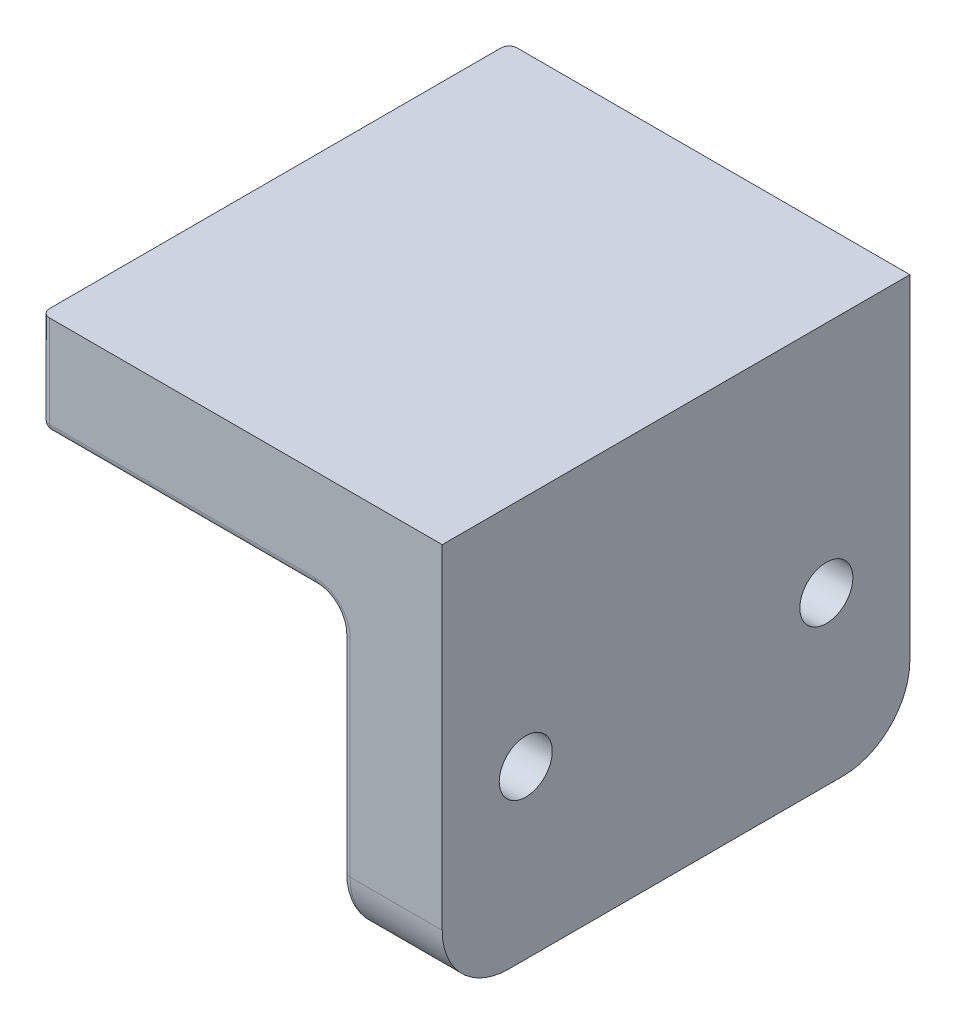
from build123d import *

# Parameters (mm, degrees)
EXTRUDE1_DEPTH                                   = 44.45
FILLET1_R                                        = 5.08
CBORE_FOR_3_8_SOCKET_HEAD_CAP_SCREW1_D           = 10.0838
CBORE_FOR_3_8_SOCKET_HEAD_CAP_SCREW1_CBORE_D     = 15.875
CBORE_FOR_3_8_SOCKET_HEAD_CAP_SCREW1_CBORE_DEPTH = 9.525
FILLET2_R                                        = 12.7
FILLET4_R                                        = 0.762
SKETCH4_W                                        = 2.645833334
SKETCH4_H                                        = 0.474893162
CUT_EXTRUDE1_DEPTH                               = 0.762
FILLET5_R                                        = 1.524
FILLET6_R                                        = 1.524


with BuildPart() as part:
    # Sketch1 → Extrude1 (new, symmetric)
    with BuildSketch(Plane.XY):
        Polygon((-76.2, 0), (-76.2, -19.05), (-19.05, -19.05), (-19.05, -76.2), (0, -76.2), (0, 0), align=None)
    extrude(amount=EXTRUDE1_DEPTH, both=True)

    # Fillet1
    fillet1_edges = [part.edges().sort_by_distance(p)[0] for p in [
        (-19.05, -19.05, 0),
    ]]
    fillet(fillet1_edges, radius=FILLET1_R)

    # CBORE for 3_8 Socket Head Cap Screw1 (through all)
    with Locations(Plane.ZY.offset(19.05)):
        with Locations((-28.575, -44.45), (28.575, -44.45)):
            CounterBoreHole(CBORE_FOR_3_8_SOCKET_HEAD_CAP_SCREW1_D / 2, CBORE_FOR_3_8_SOCKET_HEAD_CAP_SCREW1_CBORE_D / 2, CBORE_FOR_3_8_SOCKET_HEAD_CAP_SCREW1_CBORE_DEPTH)

    # Fillet2
    fillet2_edges = [part.edges().sort_by_distance(p)[0] for p in [
        (-9.525, -76.2, 44.45),
        (-9.525, -76.2, -44.45),
    ]]
    fillet(fillet2_edges, radius=FILLET2_R)

    # Fillet4
    fillet4_edges = [part.edges().sort_by_distance(p)[0] for p in [
        (-19.05, -44.45, 20.6375),
        (-9.525, -44.45, 20.6375),
        (-9.525, -44.45, 33.6169),
        (-19.05, -44.45, -36.5125),
        (-9.525, -44.45, -36.5125),
        (-9.525, -44.45, -23.5331),
    ]]
    fillet(fillet4_edges, radius=FILLET4_R)

    # Sketch4 → Cut-Extrude1 (cut)
    # profile 1 of 27: a face of its own
    with BuildSketch(Plane.XZ.offset(76.2)):
        with BuildLine():
            Line((-11.817006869, -29.627642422), (-11.817006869, -29.097627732))
            add(Edge.make_bspline(
                [(-11.817006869, -29.097627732), (-11.816851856, -29.062997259), (-11.816552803, -28.996187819), (-11.812926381, -28.899843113), (-11.806427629, -28.810960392), (-11.798396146, -28.72956013), (-11.787136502, -28.655675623), (-11.774227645, -28.58921491), (-11.758502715, -28.530162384), (-11.739831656, -28.477857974), (-11.717838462, -28.430901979), (-11.694347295, -28.386518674), (-11.666502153, -28.345376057), (-11.63631017, -28.306508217), (-11.603143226, -28.270209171), (-11.567132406, -28.236209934), (-11.527754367, -28.204860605), (-11.485280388, -28.176357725), (-11.44057521, -28.150487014), (-11.393536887, -28.127888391), (-11.344096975, -28.109556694), (-11.292573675, -28.094178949), (-11.238969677, -28.081827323), (-11.18295519, -28.073605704), (-11.124921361, -28.068021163), (-11.085423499, -28.067528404), (-11.065446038, -28.067279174)],
                knots=[0, 0, 0, 0, 1.698787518, 3.27731721, 4.728409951, 6.070286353, 7.288646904, 8.393455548, 9.389990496, 10.283725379, 11.113616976, 11.931887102, 12.744353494, 13.547053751, 14.344590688, 15.153907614, 15.974148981, 16.810666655, 17.660988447, 18.506082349, 19.367288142, 20.244738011, 21.142497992, 22.06302001, 23.020302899, 24, 24, 24, 24], degree=3))
            add(Edge.make_bspline(
                [(-11.065446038, -28.067279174), (-11.04334545, -28.067639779), (-10.999915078, -28.068348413), (-10.936251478, -28.075295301), (-10.875554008, -28.087162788), (-10.817310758, -28.102672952), (-10.76248009, -28.124300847), (-10.709753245, -28.149009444), (-10.660610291, -28.179409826), (-10.614429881, -28.214143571), (-10.570861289, -28.252089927), (-10.531070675, -28.294088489), (-10.495069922, -28.339644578), (-10.461302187, -28.387493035), (-10.432471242, -28.439605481), (-10.40557821, -28.494157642), (-10.382790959, -28.552522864), (-10.370830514, -28.593134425), (-10.364766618, -28.61372432)],
                knots=[0, 0, 0, 0, 1.101964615, 2.165495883, 3.188506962, 4.184641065, 5.166448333, 6.124117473, 7.085225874, 8.042124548, 9.003636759, 9.963451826, 10.9225791, 11.897800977, 12.880319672, 13.889154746, 14.929810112, 16, 16, 16, 16], degree=3))
            add(Edge.make_bspline(
                [(-10.364766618, -28.61372432), (-10.361392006, -28.627287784), (-10.35408151, -28.656670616), (-10.346659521, -28.705291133), (-10.339835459, -28.761321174), (-10.333971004, -28.82494192), (-10.329984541, -28.89619005), (-10.32687129, -28.974996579), (-10.324607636, -29.061397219), (-10.324527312, -29.121476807), (-10.324485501, -29.15274926)],
                knots=[0, 0, 0, 0, 0.618981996, 1.340914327, 2.176866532, 3.120127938, 4.170906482, 5.338178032, 6.614476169, 8, 8, 8, 8], degree=3))
            Line((-10.324485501, -29.15274926), (-9.171173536, -29.15274926))
            Line((-9.171173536, -29.15274926), (-9.171173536, -29.627642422))
            Line((-9.171173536, -29.627642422), (-11.817006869, -29.627642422))
        make_face()
        with BuildLine():
            Line((-10.799378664, -29.15274926), (-10.799378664, -28.984734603))
            add(Edge.make_bspline(
                [(-10.799378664, -28.984734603), (-10.799572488, -28.954161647), (-10.799929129, -28.897906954), (-10.805087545, -28.821083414), (-10.812963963, -28.759345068), (-10.824264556, -28.710574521), (-10.841403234, -28.672054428), (-10.861264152, -28.638870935), (-10.886340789, -28.610172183), (-10.915477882, -28.585850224), (-10.948300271, -28.566086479), (-10.984720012, -28.552193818), (-11.024217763, -28.543433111), (-11.051794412, -28.542600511), (-11.065976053, -28.542172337)],
                knots=[0, 0, 0, 0, 1.862197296, 3.426470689, 4.686743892, 5.65255712, 6.462325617, 7.244961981, 8.000258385, 8.771939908, 9.549006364, 10.32248703, 11.137317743, 12, 12, 12, 12], degree=3))
            add(Edge.make_bspline(
                [(-11.065976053, -28.542172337), (-11.078369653, -28.542586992), (-11.102416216, -28.543391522), (-11.137096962, -28.549383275), (-11.169363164, -28.55868278), (-11.198765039, -28.572895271), (-11.225988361, -28.590150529), (-11.250185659, -28.612040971), (-11.272139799, -28.637285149), (-11.283745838, -28.656807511), (-11.289642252, -28.666725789)],
                knots=[0, 0, 0, 0, 1.102449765, 2.139017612, 3.12397484, 4.080535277, 5.035673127, 5.982361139, 6.974944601, 8, 8, 8, 8], degree=3))
            add(Edge.make_bspline(
                [(-11.289642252, -28.666725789), (-11.293889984, -28.67512502), (-11.302883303, -28.692907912), (-11.313338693, -28.723193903), (-11.322158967, -28.758143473), (-11.329479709, -28.797992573), (-11.335161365, -28.842582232), (-11.339506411, -28.891904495), (-11.341253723, -28.946031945), (-11.341819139, -28.983674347), (-11.342113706, -29.003285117)],
                knots=[0, 0, 0, 0, 0.656809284, 1.390599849, 2.23162475, 3.173112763, 4.218524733, 5.370385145, 6.63003504, 8, 8, 8, 8], degree=3))
            Line((-11.342113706, -29.003285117), (-11.342113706, -29.15274926))
            Line((-11.342113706, -29.15274926), (-10.799378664, -29.15274926))
        make_face(mode=Mode.SUBTRACT)
    # profile 2 of 27: a face of its own
    with BuildSketch(Plane.XZ.offset(76.2)):
        Polygon((-11.817006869, -26.743832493), (-11.817006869, -26.303390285), (-9.171173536, -25.23488067), (-9.171173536, -25.742104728), (-9.713908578, -25.947750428), (-9.713908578, -27.100532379), (-9.171173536, -27.306178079), (-9.171173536, -27.812872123), align=None)
        Polygon((-11.107317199, -26.523876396), (-10.188801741, -26.920327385), (-10.188801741, -26.127425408), align=None, mode=Mode.SUBTRACT)
    # profile 3 of 27: a face of its own
    with BuildSketch(Plane.XZ.offset(76.2)):
        with BuildLine():
            Line((-11.817006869, -24.844789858), (-11.817006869, -24.291454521))
            add(Edge.make_bspline(
                [(-11.817006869, -24.291454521), (-11.816878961, -24.254878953), (-11.816632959, -24.184533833), (-11.812668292, -24.083104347), (-11.807271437, -23.989912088), (-11.798630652, -23.904910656), (-11.788443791, -23.827893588), (-11.775165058, -23.759107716), (-11.760311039, -23.698336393), (-11.741727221, -23.64514125), (-11.720798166, -23.597119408), (-11.696679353, -23.552407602), (-11.66989094, -23.509685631), (-11.638698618, -23.470330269), (-11.605885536, -23.432040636), (-11.569238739, -23.396701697), (-11.52939481, -23.363706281), (-11.486361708, -23.333650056), (-11.441048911, -23.306010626), (-11.393292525, -23.282235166), (-11.343481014, -23.261964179), (-11.291859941, -23.244931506), (-11.237914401, -23.2322319), (-11.182259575, -23.223535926), (-11.124601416, -23.21713773), (-11.085428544, -23.216771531), (-11.065446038, -23.21658473)],
                knots=[0, 0, 0, 0, 1.748890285, 3.363608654, 4.853419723, 6.211897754, 7.448506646, 8.566916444, 9.560702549, 10.437053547, 11.257979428, 12.063058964, 12.86458444, 13.665575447, 14.461919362, 15.274455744, 16.096554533, 16.933325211, 17.78237398, 18.632472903, 19.481227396, 20.352186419, 21.229229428, 22.127857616, 23.044999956, 24, 24, 24, 24], degree=3))
            add(Edge.make_bspline(
                [(-11.065446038, -23.21658473), (-11.044589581, -23.217073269), (-11.003693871, -23.218031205), (-10.943613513, -23.223148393), (-10.885993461, -23.232661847), (-10.831203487, -23.246601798), (-10.778682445, -23.263287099), (-10.729250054, -23.284896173), (-10.682031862, -23.309469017), (-10.63780598, -23.338620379), (-10.595621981, -23.370632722), (-10.557011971, -23.407811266), (-10.52014568, -23.448055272), (-10.486278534, -23.492589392), (-10.455621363, -23.541280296), (-10.426928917, -23.5932124), (-10.400710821, -23.649103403), (-10.386046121, -23.688362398), (-10.378547, -23.708438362)],
                knots=[0, 0, 0, 0, 1.099808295, 2.156523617, 3.176426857, 4.17500812, 5.135317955, 6.078349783, 7.015890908, 7.9382699, 8.868004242, 9.803692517, 10.759882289, 11.743580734, 12.748787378, 13.791075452, 14.870417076, 16, 16, 16, 16], degree=3))
            Line((-10.378547, -23.708438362), (-9.171173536, -23.097861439))
            Line((-9.171173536, -23.097861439), (-9.171173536, -23.625756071))
            Line((-9.171173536, -23.625756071), (-10.324485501, -24.20877223))
            Line((-10.324485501, -24.20877223), (-10.324485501, -24.369896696))
            Line((-10.324485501, -24.369896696), (-9.171173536, -24.369896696))
            Line((-9.171173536, -24.369896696), (-9.171173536, -24.844789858))
            Line((-9.171173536, -24.844789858), (-11.817006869, -24.844789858))
        make_face()
        with BuildLine():
            Line((-10.799378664, -24.369896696), (-10.799378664, -24.184921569))
            add(Edge.make_bspline(
                [(-10.799378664, -24.184921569), (-10.799633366, -24.162306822), (-10.800121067, -24.119004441), (-10.802383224, -24.05672993), (-10.807833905, -24.000169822), (-10.814720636, -23.949081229), (-10.822672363, -23.903207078), (-10.834067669, -23.862956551), (-10.846278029, -23.827709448), (-10.861452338, -23.797883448), (-10.878708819, -23.772400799), (-10.89831261, -23.750398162), (-10.921001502, -23.732198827), (-10.946158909, -23.717219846), (-10.974007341, -23.705567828), (-11.004241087, -23.697062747), (-11.037204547, -23.692309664), (-11.059953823, -23.691762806), (-11.071806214, -23.691477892)],
                knots=[0, 0, 0, 0, 1.688639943, 3.233382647, 4.650958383, 5.928841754, 7.082724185, 8.122798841, 9.049171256, 9.863274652, 10.613301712, 11.341792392, 12.054588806, 12.776240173, 13.521029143, 14.301969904, 15.115324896, 16, 16, 16, 16], degree=3))
            add(Edge.make_bspline(
                [(-11.071806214, -23.691477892), (-11.085836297, -23.691990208), (-11.113224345, -23.692990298), (-11.152764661, -23.703803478), (-11.189626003, -23.7201205), (-11.223308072, -23.743215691), (-11.252747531, -23.772045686), (-11.278754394, -23.805139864), (-11.299089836, -23.843359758), (-11.313369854, -23.878400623), (-11.321385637, -23.910582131), (-11.327404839, -23.939525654), (-11.331877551, -23.97301298), (-11.335498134, -24.0112138), (-11.338729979, -24.053790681), (-11.340786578, -24.101160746), (-11.341692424, -24.153117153), (-11.341969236, -24.189338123), (-11.342113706, -24.208242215)],
                knots=[0, 0, 0, 0, 1.020140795, 1.991411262, 2.965409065, 3.947543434, 4.949233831, 5.95883764, 7.001880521, 8.094604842, 8.706727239, 9.41631554, 10.248493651, 11.167128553, 12.212949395, 13.360078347, 14.622198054, 16, 16, 16, 16], degree=3))
            Line((-11.342113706, -24.208242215), (-11.342113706, -24.369896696))
            Line((-11.342113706, -24.369896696), (-10.799378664, -24.369896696))
        make_face(mode=Mode.SUBTRACT)
    # profile 4 of 27: a face of its own
    with BuildSketch(Plane.XZ.offset(76.2)):
        Polygon((-11.817006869, -22.979138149), (-11.817006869, -21.554458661), (-11.342113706, -21.554458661), (-11.342113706, -22.029351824), (-9.171173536, -22.029351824), (-9.171173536, -22.504244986), (-11.342113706, -22.504244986), (-11.342113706, -22.979138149), align=None)
    # profile 5 of 27: a face of its own
    with BuildSketch(Plane.XZ.offset(76.2)):
        Polygon((-11.817006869, -20.163700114), (-11.817006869, -19.735978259), (-10.075908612, -18.535494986), (-11.817006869, -18.535494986), (-11.817006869, -18.060601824), (-9.171173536, -18.060601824), (-9.171173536, -18.491503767), (-10.906971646, -19.688806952), (-9.171173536, -19.688806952), (-9.171173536, -20.163700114), align=None)
    # profile 6 of 27: a face of its own
    with BuildSketch(Plane.XZ.offset(76.2)):
        with BuildLine():
            Line((-11.817006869, -17.450024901), (-11.817006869, -16.975131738))
            Line((-11.817006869, -16.975131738), (-10.095519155, -16.975131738))
            add(Edge.make_bspline(
                [(-10.095519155, -16.975131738), (-10.07767164, -16.975104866), (-10.04319935, -16.975052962), (-9.99374092, -16.972570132), (-9.948109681, -16.970230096), (-9.906675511, -16.966248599), (-9.869309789, -16.960003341), (-9.835874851, -16.954172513), (-9.806668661, -16.946178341), (-9.773401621, -16.934207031), (-9.736029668, -16.915517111), (-9.696638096, -16.885873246), (-9.661576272, -16.850473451), (-9.632136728, -16.808784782), (-9.607236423, -16.762240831), (-9.590766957, -16.709924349), (-9.579596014, -16.653536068), (-9.578690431, -16.614250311), (-9.578224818, -16.594051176)],
                knots=[0, 0, 0, 0, 1.155195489, 2.231248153, 3.20507519, 4.113220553, 4.92363642, 5.657123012, 6.309133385, 6.880755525, 7.944644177, 8.999147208, 10.058600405, 11.156792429, 12.29246015, 13.460660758, 14.694375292, 16, 16, 16, 16], degree=3))
            add(Edge.make_bspline(
                [(-9.578224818, -16.594051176), (-9.57885033, -16.572615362), (-9.580069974, -16.530819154), (-9.592042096, -16.470701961), (-9.611105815, -16.415003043), (-9.638314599, -16.364901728), (-9.670929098, -16.320447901), (-9.708119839, -16.282818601), (-9.749961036, -16.253121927), (-9.788562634, -16.233766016), (-9.824092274, -16.222900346), (-9.85583586, -16.214749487), (-9.893120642, -16.208830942), (-9.935687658, -16.203289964), (-9.983847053, -16.200148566), (-10.037347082, -16.196570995), (-10.096220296, -16.195288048), (-10.137213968, -16.195065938), (-10.158590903, -16.194950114)],
                knots=[0, 0, 0, 0, 1.26131785, 2.459356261, 3.594833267, 4.716926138, 5.803419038, 6.833631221, 7.818372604, 8.814377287, 9.360705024, 10.004324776, 10.743421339, 11.582437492, 12.532246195, 13.585177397, 14.740744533, 16, 16, 16, 16], degree=3))
            Line((-10.158590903, -16.194950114), (-11.817006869, -16.194950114))
            Line((-11.817006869, -16.194950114), (-11.817006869, -15.720056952))
            Line((-11.817006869, -15.720056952), (-10.238623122, -15.720056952))
            add(Edge.make_bspline(
                [(-10.238623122, -15.720056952), (-10.206645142, -15.720122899), (-10.145154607, -15.72024971), (-10.05678838, -15.72219714), (-9.976080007, -15.726342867), (-9.903005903, -15.729824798), (-9.837664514, -15.73656353), (-9.779776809, -15.743583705), (-9.729547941, -15.752531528), (-9.672368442, -15.765845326), (-9.60652858, -15.788821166), (-9.530715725, -15.825860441), (-9.45649467, -15.872882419), (-9.38466043, -15.928448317), (-9.317992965, -15.991231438), (-9.259301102, -16.059566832), (-9.210465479, -16.133141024), (-9.17097964, -16.21161417), (-9.140575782, -16.295814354), (-9.119085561, -16.385940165), (-9.105410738, -16.482507), (-9.104038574, -16.549128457), (-9.103331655, -16.583450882)],
                knots=[0, 0, 0, 0, 1.170930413, 2.251584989, 3.235934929, 4.130173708, 4.929654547, 5.640582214, 6.264911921, 6.796838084, 7.789064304, 8.810388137, 9.880124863, 11.000704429, 12.131026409, 13.227749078, 14.29171941, 15.356377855, 16.43689688, 17.561893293, 18.743922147, 20, 20, 20, 20], degree=3))
            add(Edge.make_bspline(
                [(-9.103331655, -16.583450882), (-9.10371692, -16.60625802), (-9.104477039, -16.651256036), (-9.111144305, -16.717439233), (-9.121050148, -16.781396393), (-9.135221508, -16.843161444), (-9.154566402, -16.902521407), (-9.17742735, -16.959860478), (-9.203584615, -17.015386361), (-9.235329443, -17.067363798), (-9.268673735, -17.117069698), (-9.305157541, -17.162836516), (-9.343162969, -17.205367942), (-9.383559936, -17.244169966), (-9.426060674, -17.279278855), (-9.470706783, -17.310667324), (-9.517508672, -17.338276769), (-9.567306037, -17.362805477), (-9.622631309, -17.383797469), (-9.685450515, -17.401503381), (-9.756584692, -17.41689552), (-9.836502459, -17.428547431), (-9.924839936, -17.438817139), (-10.021934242, -17.445471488), (-10.127471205, -17.448906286), (-10.200636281, -17.449642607), (-10.238623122, -17.450024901)],
                knots=[0, 0, 0, 0, 1.001237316, 1.975420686, 2.917953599, 3.841913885, 4.754568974, 5.656377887, 6.55158913, 7.445656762, 8.327865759, 9.178398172, 10.013362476, 10.830881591, 11.635451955, 12.431789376, 13.224756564, 14.019278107, 14.866442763, 15.819105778, 16.882716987, 18.059987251, 19.363897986, 20.787153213, 22.331910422, 24, 24, 24, 24], degree=3))
            Line((-10.238623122, -17.450024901), (-11.817006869, -17.450024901))
        make_face()
    # profile 7 of 27: a face of its own
    with BuildSketch(Plane.XZ.offset(76.2)):
        Polygon((-11.817006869, -14.900124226), (-11.817006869, -14.407210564), (-9.971495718, -13.803523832), (-11.817006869, -13.195596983), (-11.817006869, -12.707453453), (-9.171173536, -12.260121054), (-9.171173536, -12.740844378), (-10.842309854, -13.023342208), (-9.171173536, -13.573497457), (-9.171173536, -14.036730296), (-10.842309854, -14.583705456), (-9.171173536, -14.865673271), (-9.171173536, -15.34692661), align=None)
    # profile 8 of 27: a face of its own
    with BuildSketch(Plane.XZ.offset(76.2)):
        with BuildLine():
            Line((-9.171173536, -11.819148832), (-11.817006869, -11.819148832))
            Line((-11.817006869, -11.819148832), (-11.817006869, -11.39513708))
            add(Edge.make_bspline(
                [(-11.817006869, -11.39513708), (-11.817010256, -11.365453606), (-11.817016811, -11.308016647), (-11.814106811, -11.225150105), (-11.810342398, -11.148298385), (-11.806130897, -11.07770606), (-11.798873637, -11.013252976), (-11.791225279, -10.955037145), (-11.78200183, -10.902942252), (-11.773728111, -10.87073481), (-11.769835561, -10.855582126)],
                knots=[0, 0, 0, 0, 1.311965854, 2.538629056, 3.664479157, 4.713267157, 5.663616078, 6.530575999, 7.308677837, 8, 8, 8, 8], degree=3))
            add(Edge.make_bspline(
                [(-11.769835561, -10.855582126), (-11.764344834, -10.835685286), (-11.753570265, -10.796641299), (-11.731814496, -10.740714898), (-11.707616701, -10.687672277), (-11.680065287, -10.637524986), (-11.648646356, -10.590866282), (-11.61395941, -10.547055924), (-11.575991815, -10.506300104), (-11.534521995, -10.469239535), (-11.490629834, -10.435814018), (-11.444340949, -10.406559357), (-11.39616147, -10.381602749), (-11.345988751, -10.361224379), (-11.293885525, -10.346021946), (-11.240016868, -10.334874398), (-11.184188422, -10.327656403), (-11.146207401, -10.326973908), (-11.126927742, -10.326627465)],
                knots=[0, 0, 0, 0, 1.099825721, 2.158211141, 3.195041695, 4.206926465, 5.204905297, 6.190538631, 7.183526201, 8.170733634, 9.152262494, 10.121785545, 11.086538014, 12.041584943, 13.004265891, 13.975982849, 14.972582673, 16, 16, 16, 16], degree=3))
            add(Edge.make_bspline(
                [(-11.126927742, -10.326627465), (-11.102157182, -10.327530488), (-11.053399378, -10.32930798), (-10.981802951, -10.340728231), (-10.914211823, -10.361900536), (-10.849436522, -10.390285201), (-10.787078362, -10.42776668), (-10.727912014, -10.476230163), (-10.66989471, -10.53388863), (-10.635134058, -10.578151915), (-10.61705361, -10.601175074)],
                knots=[0, 0, 0, 0, 0.986208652, 1.941230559, 2.875571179, 3.798165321, 4.751009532, 5.761494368, 6.83566093, 8, 8, 8, 8], degree=3))
            add(Edge.make_bspline(
                [(-10.61705361, -10.601175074), (-10.607531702, -10.582519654), (-10.588861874, -10.545941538), (-10.558156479, -10.494027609), (-10.525564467, -10.445899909), (-10.491512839, -10.401719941), (-10.455490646, -10.361215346), (-10.417616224, -10.325033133), (-10.378075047, -10.292240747), (-10.336594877, -10.263482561), (-10.292962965, -10.238692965), (-10.247818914, -10.216883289), (-10.200761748, -10.198107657), (-10.151689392, -10.182850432), (-10.10066396, -10.171077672), (-10.047803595, -10.163518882), (-9.993177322, -10.157702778), (-9.955965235, -10.157251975), (-9.937044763, -10.157022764)],
                knots=[0, 0, 0, 0, 1.164539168, 2.28333912, 3.351515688, 4.395009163, 5.383055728, 6.362812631, 7.305003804, 8.237049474, 9.165619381, 10.092784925, 11.02322402, 11.98030579, 12.947919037, 13.931657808, 14.948352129, 16, 16, 16, 16], degree=3))
            add(Edge.make_bspline(
                [(-9.937044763, -10.157022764), (-9.900907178, -10.158511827), (-9.829589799, -10.161450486), (-9.724895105, -10.182988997), (-9.625719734, -10.220130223), (-9.532586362, -10.270481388), (-9.447777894, -10.332212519), (-9.37287948, -10.402812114), (-9.309949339, -10.482493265), (-9.267421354, -10.555786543), (-9.238927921, -10.619211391), (-9.221230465, -10.67172528), (-9.205159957, -10.728225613), (-9.192585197, -10.789353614), (-9.183240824, -10.854690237), (-9.176425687, -10.924192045), (-9.172129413, -10.9981027), (-9.171498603, -11.048854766), (-9.171173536, -11.075008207)],
                knots=[0, 0, 0, 0, 1.284195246, 2.534354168, 3.78027825, 5.036354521, 6.286276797, 7.499025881, 8.683874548, 9.882754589, 10.501292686, 11.152751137, 11.850656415, 12.588451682, 13.369156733, 14.195917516, 15.070324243, 16, 16, 16, 16], degree=3))
            Line((-9.171173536, -11.075008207), (-9.171173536, -11.819148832))
        make_face()
        with BuildLine():
            Line((-11.342113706, -11.34425567), (-10.765457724, -11.34425567))
            Line((-10.765457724, -11.34425567), (-10.765457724, -11.218112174))
            add(Edge.make_bspline(
                [(-10.765457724, -11.218112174), (-10.765607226, -11.200968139), (-10.765895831, -11.167872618), (-10.76961297, -11.120069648), (-10.775954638, -11.075620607), (-10.784802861, -11.034694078), (-10.796038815, -10.996908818), (-10.809558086, -10.962506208), (-10.826053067, -10.931637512), (-10.850623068, -10.895775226), (-10.886778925, -10.857866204), (-10.939013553, -10.824495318), (-10.999083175, -10.804840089), (-11.041448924, -10.802651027), (-11.063325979, -10.801520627)],
                knots=[0, 0, 0, 0, 1.065314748, 2.056525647, 2.977365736, 3.853934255, 4.656397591, 5.425096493, 6.14721249, 6.826394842, 8.123232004, 9.372140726, 10.643011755, 12, 12, 12, 12], degree=3))
            add(Edge.make_bspline(
                [(-11.063325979, -10.801520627), (-11.083817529, -10.80242514), (-11.123437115, -10.804173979), (-11.179065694, -10.823964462), (-11.228367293, -10.854701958), (-11.262099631, -10.890995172), (-11.285162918, -10.925164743), (-11.300272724, -10.954444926), (-11.314095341, -10.986445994), (-11.323418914, -11.022319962), (-11.332338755, -11.060916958), (-11.337734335, -11.102983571), (-11.34172652, -11.148072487), (-11.341981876, -11.179234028), (-11.342113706, -11.195321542)],
                knots=[0, 0, 0, 0, 1.348076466, 2.606451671, 3.849585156, 5.153713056, 5.843081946, 6.568636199, 7.327130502, 8.139792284, 9.011860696, 9.942616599, 10.937851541, 12, 12, 12, 12], degree=3))
            Line((-11.342113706, -11.195321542), (-11.342113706, -11.34425567))
        make_face(mode=Mode.SUBTRACT)
        with BuildLine():
            Line((-10.324485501, -11.34425567), (-9.646066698, -11.34425567))
            Line((-9.646066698, -11.34425567), (-9.646066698, -11.20751188))
            add(Edge.make_bspline(
                [(-9.646066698, -11.20751188), (-9.646223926, -11.180478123), (-9.646526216, -11.128502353), (-9.650077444, -11.054036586), (-9.656664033, -10.986365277), (-9.664354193, -10.925472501), (-9.676513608, -10.871856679), (-9.689156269, -10.824538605), (-9.705418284, -10.784338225), (-9.724276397, -10.750569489), (-9.745608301, -10.722327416), (-9.768694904, -10.697871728), (-9.794491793, -10.677473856), (-9.822428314, -10.661069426), (-9.852246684, -10.647289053), (-9.884936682, -10.638847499), (-9.919481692, -10.632450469), (-9.943372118, -10.63209685), (-9.955595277, -10.631915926)],
                knots=[0, 0, 0, 0, 1.753677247, 3.371663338, 4.833688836, 6.164395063, 7.349095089, 8.3975697, 9.338276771, 10.154261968, 10.899224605, 11.628775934, 12.330426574, 13.024264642, 13.727131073, 14.452891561, 15.208446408, 16, 16, 16, 16], degree=3))
            add(Edge.make_bspline(
                [(-9.955595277, -10.631915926), (-9.969573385, -10.632313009), (-9.996798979, -10.633086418), (-10.036585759, -10.639421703), (-10.073753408, -10.650887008), (-10.109278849, -10.66554296), (-10.142145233, -10.685369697), (-10.17285252, -10.709518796), (-10.200658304, -10.738421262), (-10.227188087, -10.770992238), (-10.250608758, -10.808796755), (-10.270010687, -10.852470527), (-10.287078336, -10.901352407), (-10.300436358, -10.956262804), (-10.311853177, -11.016711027), (-10.318651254, -11.083193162), (-10.323713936, -11.155138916), (-10.324222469, -11.205028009), (-10.324485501, -11.230832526)],
                knots=[0, 0, 0, 0, 0.844975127, 1.645784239, 2.426462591, 3.192310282, 3.963577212, 4.739343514, 5.547598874, 6.383408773, 7.27567655, 8.226932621, 9.267447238, 10.402227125, 11.640487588, 12.984111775, 14.440069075, 16, 16, 16, 16], degree=3))
            Line((-10.324485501, -11.230832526), (-10.324485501, -11.34425567))
        make_face(mode=Mode.SUBTRACT)
    # profile 9 of 27: a face of its own
    with BuildSketch(Plane.XZ.offset(76.2)):
        Polygon((-11.817006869, -9.682129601), (-11.817006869, -8.257450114), (-11.342113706, -8.257450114), (-11.342113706, -9.207236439), (-10.833299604, -9.207236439), (-10.833299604, -8.257450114), (-10.358406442, -8.257450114), (-10.358406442, -9.207236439), (-9.646066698, -9.207236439), (-9.646066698, -8.257450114), (-9.171173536, -8.257450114), (-9.171173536, -9.682129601), align=None)
    # profile 10 of 27: a face of its own
    with BuildSketch(Plane.XZ.offset(76.2)):
        with BuildLine():
            Line((-11.817006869, -7.782556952), (-11.817006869, -7.229221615))
            add(Edge.make_bspline(
                [(-11.817006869, -7.229221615), (-11.816878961, -7.192646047), (-11.816632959, -7.122300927), (-11.812668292, -7.020871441), (-11.807271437, -6.927679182), (-11.798630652, -6.84267775), (-11.788443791, -6.765660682), (-11.775165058, -6.69687481), (-11.760311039, -6.636103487), (-11.741727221, -6.582908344), (-11.720798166, -6.534886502), (-11.696679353, -6.490174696), (-11.66989094, -6.447452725), (-11.638698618, -6.408097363), (-11.605885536, -6.36980773), (-11.569238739, -6.334468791), (-11.52939481, -6.301473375), (-11.486361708, -6.27141715), (-11.441048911, -6.24377772), (-11.393292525, -6.22000226), (-11.343481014, -6.199731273), (-11.291859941, -6.1826986), (-11.237914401, -6.169998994), (-11.182259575, -6.16130302), (-11.124601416, -6.154904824), (-11.085428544, -6.154538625), (-11.065446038, -6.154351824)],
                knots=[0, 0, 0, 0, 1.748890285, 3.363608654, 4.853419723, 6.211897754, 7.448506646, 8.566916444, 9.560702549, 10.437053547, 11.257979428, 12.063058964, 12.86458444, 13.665575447, 14.461919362, 15.274455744, 16.096554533, 16.933325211, 17.78237398, 18.632472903, 19.481227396, 20.352186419, 21.229229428, 22.127857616, 23.044999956, 24, 24, 24, 24], degree=3))
            add(Edge.make_bspline(
                [(-11.065446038, -6.154351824), (-11.044589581, -6.154840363), (-11.003693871, -6.155798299), (-10.943613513, -6.160915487), (-10.885993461, -6.170428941), (-10.831203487, -6.184368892), (-10.778682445, -6.201054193), (-10.729250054, -6.222663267), (-10.682031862, -6.247236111), (-10.63780598, -6.276387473), (-10.595621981, -6.308399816), (-10.557011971, -6.34557836), (-10.52014568, -6.385822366), (-10.486278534, -6.430356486), (-10.455621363, -6.47904739), (-10.426928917, -6.530979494), (-10.400710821, -6.586870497), (-10.386046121, -6.626129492), (-10.378547, -6.646205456)],
                knots=[0, 0, 0, 0, 1.099808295, 2.156523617, 3.176426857, 4.17500812, 5.135317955, 6.078349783, 7.015890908, 7.9382699, 8.868004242, 9.803692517, 10.759882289, 11.743580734, 12.748787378, 13.791075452, 14.870417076, 16, 16, 16, 16], degree=3))
            Line((-10.378547, -6.646205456), (-9.171173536, -6.035628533))
            Line((-9.171173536, -6.035628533), (-9.171173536, -6.563523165))
            Line((-9.171173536, -6.563523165), (-10.324485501, -7.146539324))
            Line((-10.324485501, -7.146539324), (-10.324485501, -7.30766379))
            Line((-10.324485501, -7.30766379), (-9.171173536, -7.30766379))
            Line((-9.171173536, -7.30766379), (-9.171173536, -7.782556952))
            Line((-9.171173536, -7.782556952), (-11.817006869, -7.782556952))
        make_face()
        with BuildLine():
            Line((-10.799378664, -7.30766379), (-10.799378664, -7.122688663))
            add(Edge.make_bspline(
                [(-10.799378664, -7.122688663), (-10.799633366, -7.100073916), (-10.800121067, -7.056771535), (-10.802383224, -6.994497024), (-10.807833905, -6.937936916), (-10.814720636, -6.886848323), (-10.822672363, -6.840974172), (-10.834067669, -6.800723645), (-10.846278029, -6.765476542), (-10.861452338, -6.735650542), (-10.878708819, -6.710167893), (-10.89831261, -6.688165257), (-10.921001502, -6.669965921), (-10.946158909, -6.65498694), (-10.974007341, -6.643334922), (-11.004241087, -6.634829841), (-11.037204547, -6.630076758), (-11.059953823, -6.6295299), (-11.071806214, -6.629244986)],
                knots=[0, 0, 0, 0, 1.688639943, 3.233382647, 4.650958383, 5.928841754, 7.082724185, 8.122798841, 9.049171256, 9.863274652, 10.613301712, 11.341792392, 12.054588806, 12.776240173, 13.521029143, 14.301969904, 15.115324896, 16, 16, 16, 16], degree=3))
            add(Edge.make_bspline(
                [(-11.071806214, -6.629244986), (-11.085836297, -6.629757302), (-11.113224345, -6.630757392), (-11.152764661, -6.641570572), (-11.189626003, -6.657887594), (-11.223308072, -6.680982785), (-11.252747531, -6.70981278), (-11.278754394, -6.742906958), (-11.299089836, -6.781126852), (-11.313369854, -6.816167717), (-11.321385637, -6.848349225), (-11.327404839, -6.877292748), (-11.331877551, -6.910780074), (-11.335498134, -6.948980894), (-11.338729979, -6.991557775), (-11.340786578, -7.03892784), (-11.341692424, -7.090884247), (-11.341969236, -7.127105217), (-11.342113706, -7.146009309)],
                knots=[0, 0, 0, 0, 1.020140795, 1.991411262, 2.965409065, 3.947543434, 4.949233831, 5.95883764, 7.001880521, 8.094604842, 8.706727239, 9.41631554, 10.248493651, 11.167128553, 12.212949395, 13.360078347, 14.622198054, 16, 16, 16, 16], degree=3))
            Line((-11.342113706, -7.146009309), (-11.342113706, -7.30766379))
            Line((-11.342113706, -7.30766379), (-10.799378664, -7.30766379))
        make_face(mode=Mode.SUBTRACT)
    # profile 11 of 27: a face of its own
    with BuildSketch(Plane.XZ.offset(76.2)):
        Polygon((-11.817006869, -4.344351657), (-11.817006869, -3.610281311), (-9.171173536, -3.610281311), (-9.171173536, -4.085174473), (-11.376034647, -4.085174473), (-11.376034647, -4.627909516), align=None)
    # profile 12 of 27: a face of its own
    with BuildSketch(Plane.XZ.offset(76.2)):
        with BuildLine():
            Line((-10.935062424, -2.253443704), (-10.935062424, -2.728336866))
            add(Edge.make_bspline(
                [(-10.935062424, -2.728336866), (-10.970985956, -2.726286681), (-11.041178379, -2.722280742), (-11.143128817, -2.70632865), (-11.239484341, -2.685008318), (-11.329955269, -2.656310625), (-11.414579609, -2.620962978), (-11.493077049, -2.578085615), (-11.56601006, -2.528958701), (-11.632099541, -2.472591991), (-11.691515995, -2.411273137), (-11.743459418, -2.345159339), (-11.786942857, -2.274438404), (-11.82261252, -2.199583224), (-11.851152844, -2.120887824), (-11.870224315, -2.037557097), (-11.883142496, -1.950326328), (-11.884272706, -1.890609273), (-11.884848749, -1.860172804)],
                knots=[0, 0, 0, 0, 1.198928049, 2.342633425, 3.435730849, 4.486331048, 5.502589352, 6.488331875, 7.46361919, 8.428949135, 9.378681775, 10.305958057, 11.226249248, 12.140413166, 13.066341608, 14.010670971, 14.986082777, 16, 16, 16, 16], degree=3))
            add(Edge.make_bspline(
                [(-11.884848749, -1.860172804), (-11.883761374, -1.822795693), (-11.881637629, -1.749794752), (-11.861127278, -1.644071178), (-11.829719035, -1.544802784), (-11.784087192, -1.453045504), (-11.726545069, -1.36895887), (-11.657801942, -1.293010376), (-11.577022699, -1.226681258), (-11.486533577, -1.170488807), (-11.390526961, -1.124020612), (-11.291433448, -1.091145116), (-11.191810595, -1.069650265), (-11.12473755, -1.06735236), (-11.091416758, -1.066210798)],
                knots=[0, 0, 0, 0, 1.075374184, 2.100304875, 3.089917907, 4.066149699, 5.039978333, 6.01615708, 7.006437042, 8.039858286, 9.077679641, 10.07047942, 11.041445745, 12, 12, 12, 12], degree=3))
            add(Edge.make_bspline(
                [(-11.091416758, -1.066210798), (-11.0712616, -1.066654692), (-11.030694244, -1.06754814), (-10.969305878, -1.073760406), (-10.906774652, -1.083080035), (-10.843154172, -1.097131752), (-10.778426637, -1.114655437), (-10.71239821, -1.135914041), (-10.64544376, -1.161401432), (-10.576807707, -1.190689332), (-10.50627531, -1.225639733), (-10.432755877, -1.266294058), (-10.356327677, -1.314011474), (-10.276241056, -1.367238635), (-10.193718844, -1.42806951), (-10.107844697, -1.494892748), (-10.01875393, -1.568044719), (-9.959174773, -1.6199231), (-9.928564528, -1.646576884)],
                knots=[0, 0, 0, 0, 0.728277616, 1.465842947, 2.227925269, 3.011838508, 3.818735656, 4.650581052, 5.517389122, 6.406849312, 7.346234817, 8.360743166, 9.441530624, 10.601362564, 11.834937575, 13.145232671, 14.533293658, 16, 16, 16, 16], degree=3))
            Line((-9.928564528, -1.646576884), (-9.612145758, -1.922714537))
            Line((-9.612145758, -1.922714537), (-9.612145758, -1.032289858))
            Line((-9.612145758, -1.032289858), (-9.171173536, -1.032289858))
            Line((-9.171173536, -1.032289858), (-9.171173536, -2.796178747))
            Line((-9.171173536, -2.796178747), (-9.411800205, -2.796178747))
            Line((-9.411800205, -2.796178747), (-10.245513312, -2.012817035))
            add(Edge.make_bspline(
                [(-10.245513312, -2.012817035), (-10.269832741, -1.990136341), (-10.316932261, -1.946210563), (-10.38610687, -1.883714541), (-10.451737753, -1.827140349), (-10.514586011, -1.777752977), (-10.572523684, -1.732564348), (-10.627741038, -1.694760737), (-10.678683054, -1.661838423), (-10.740779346, -1.627447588), (-10.814280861, -1.594035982), (-10.898905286, -1.563398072), (-10.979843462, -1.544909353), (-11.032678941, -1.542337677), (-11.058025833, -1.54110396)],
                knots=[0, 0, 0, 0, 1.246192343, 2.413505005, 3.49357156, 4.492416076, 5.408771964, 6.246246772, 6.999304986, 7.680960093, 8.904522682, 10.020616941, 11.0504258, 12, 12, 12, 12], degree=3))
            add(Edge.make_bspline(
                [(-11.058025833, -1.54110396), (-11.082547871, -1.542023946), (-11.130063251, -1.543806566), (-11.197653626, -1.563396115), (-11.258849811, -1.593744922), (-11.311823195, -1.636510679), (-11.355354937, -1.688313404), (-11.387732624, -1.748176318), (-11.406414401, -1.815611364), (-11.408752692, -1.862884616), (-11.409955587, -1.887203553)],
                knots=[0, 0, 0, 0, 1.062038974, 2.057870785, 3.028805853, 4.01125022, 4.991535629, 5.949134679, 6.94496649, 8, 8, 8, 8], degree=3))
            add(Edge.make_bspline(
                [(-11.409955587, -1.887203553), (-11.409511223, -1.899767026), (-11.408636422, -1.924500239), (-11.402813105, -1.96085613), (-11.392550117, -1.995451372), (-11.378799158, -2.02867103), (-11.360572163, -2.060160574), (-11.338104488, -2.089840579), (-11.311967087, -2.118023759), (-11.282241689, -2.144580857), (-11.249068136, -2.168751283), (-11.2127494, -2.190219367), (-11.173308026, -2.207969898), (-11.131264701, -2.223598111), (-11.086167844, -2.235651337), (-11.038287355, -2.24442758), (-10.98770113, -2.251099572), (-10.952927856, -2.252648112), (-10.935062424, -2.253443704)],
                knots=[0, 0, 0, 0, 0.903469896, 1.778625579, 2.63899355, 3.493148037, 4.358286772, 5.247621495, 6.164656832, 7.118446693, 8.109501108, 9.111810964, 10.146451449, 11.215617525, 12.33435995, 13.498009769, 14.714554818, 16, 16, 16, 16], degree=3))
        make_face()
    # profile 13 of 27: a face of its own
    with BuildSketch(Plane.XZ.offset(76.2)):
        with BuildLine():
            Line((-11.172509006, -0.082503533), (-11.172509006, -0.557396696))
            add(Edge.make_bspline(
                [(-11.172509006, -0.557396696), (-11.196252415, -0.554064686), (-11.242629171, -0.547556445), (-11.309931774, -0.531557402), (-11.373931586, -0.513055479), (-11.434285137, -0.489394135), (-11.490927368, -0.462081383), (-11.543908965, -0.430231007), (-11.593990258, -0.395320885), (-11.624002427, -0.367988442), (-11.638921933, -0.354401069)],
                knots=[0, 0, 0, 0, 1.1115466, 2.171125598, 3.205689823, 4.19946166, 5.17440286, 6.118867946, 7.064860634, 8, 8, 8, 8], degree=3))
            add(Edge.make_bspline(
                [(-11.638921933, -0.354401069), (-11.658637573, -0.334851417), (-11.697495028, -0.296321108), (-11.747267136, -0.231932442), (-11.79034151, -0.164441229), (-11.824491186, -0.092493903), (-11.852131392, -0.017210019), (-11.870697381, 0.062009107), (-11.883016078, 0.144839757), (-11.884229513, 0.201361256), (-11.884848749, 0.230205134)],
                knots=[0, 0, 0, 0, 1.01925491, 2.00884431, 2.983262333, 3.955970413, 4.92937149, 5.924503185, 6.940838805, 8, 8, 8, 8], degree=3))
            add(Edge.make_bspline(
                [(-11.884848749, 0.230205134), (-11.884243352, 0.255848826), (-11.883053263, 0.306259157), (-11.873499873, 0.38034966), (-11.856744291, 0.450988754), (-11.834836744, 0.518923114), (-11.805027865, 0.583153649), (-11.7704261, 0.645097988), (-11.727985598, 0.703025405), (-11.680032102, 0.757071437), (-11.628165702, 0.806723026), (-11.572724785, 0.849721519), (-11.515190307, 0.886688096), (-11.455084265, 0.917143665), (-11.392304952, 0.940559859), (-11.327215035, 0.956811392), (-11.259958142, 0.967448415), (-11.214244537, 0.968508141), (-11.19105952, 0.969045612)],
                knots=[0, 0, 0, 0, 1.091422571, 2.145516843, 3.172569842, 4.178562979, 5.178154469, 6.181868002, 7.194278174, 8.227918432, 9.254613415, 10.245994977, 11.209837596, 12.161663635, 13.10878368, 14.055455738, 15.013766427, 16, 16, 16, 16], degree=3))
            add(Edge.make_bspline(
                [(-11.19105952, 0.969045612), (-11.162351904, 0.967921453), (-11.105662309, 0.965701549), (-11.022856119, 0.948145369), (-10.943858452, 0.919922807), (-10.869605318, 0.879794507), (-10.800174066, 0.829402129), (-10.737989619, 0.767605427), (-10.68208894, 0.696128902), (-10.652047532, 0.642472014), (-10.636664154, 0.614995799)],
                knots=[0, 0, 0, 0, 0.992776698, 1.96045919, 2.915875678, 3.886951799, 4.871409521, 5.874469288, 6.911574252, 8, 8, 8, 8], degree=3))
            add(Edge.make_bspline(
                [(-10.636664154, 0.614995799), (-10.630473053, 0.633855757), (-10.618307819, 0.670914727), (-10.594333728, 0.723578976), (-10.568189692, 0.773697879), (-10.537669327, 0.820125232), (-10.504888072, 0.864134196), (-10.468083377, 0.904332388), (-10.42819996, 0.941760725), (-10.384813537, 0.975493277), (-10.338645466, 1.005651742), (-10.290525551, 1.032230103), (-10.240277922, 1.054534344), (-10.188271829, 1.073254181), (-10.133995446, 1.087536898), (-10.07763271, 1.097585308), (-10.019319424, 1.103395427), (-9.979811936, 1.104281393), (-9.959835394, 1.104729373)],
                knots=[0, 0, 0, 0, 1.059375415, 2.081625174, 3.086260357, 4.075579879, 5.045586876, 6.014170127, 6.982201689, 7.963705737, 8.945119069, 9.924852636, 10.896327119, 11.878239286, 12.873838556, 13.889973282, 14.933087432, 16, 16, 16, 16], degree=3))
            add(Edge.make_bspline(
                [(-9.959835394, 1.104729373), (-9.930478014, 1.103821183), (-9.872591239, 1.102030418), (-9.787330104, 1.090645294), (-9.706040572, 1.069449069), (-9.627790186, 1.041561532), (-9.553578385, 1.004372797), (-9.481742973, 0.960570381), (-9.414720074, 0.906954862), (-9.35122346, 0.846830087), (-9.29321357, 0.780406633), (-9.24196119, 0.708930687), (-9.19971173, 0.632263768), (-9.163599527, 0.552259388), (-9.136798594, 0.467115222), (-9.117171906, 0.377932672), (-9.105230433, 0.284060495), (-9.103973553, 0.219993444), (-9.103331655, 0.187273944)],
                knots=[0, 0, 0, 0, 1.005228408, 1.982105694, 2.937129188, 3.876607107, 4.82066901, 5.774063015, 6.75178259, 7.752926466, 8.764612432, 9.766578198, 10.757677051, 11.756882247, 12.76686714, 13.807379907, 14.880213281, 16, 16, 16, 16], degree=3))
            add(Edge.make_bspline(
                [(-9.103331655, 0.187273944), (-9.104006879, 0.156321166), (-9.10532719, 0.095797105), (-9.11675515, 0.007267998), (-9.135189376, -0.076870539), (-9.161173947, -0.156833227), (-9.194871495, -0.232310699), (-9.234997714, -0.303987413), (-9.28386699, -0.370433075), (-9.339273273, -0.432388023), (-9.401435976, -0.488477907), (-9.468915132, -0.538609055), (-9.541967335, -0.581676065), (-9.620280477, -0.617855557), (-9.703991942, -0.646864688), (-9.792931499, -0.669747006), (-9.887272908, -0.685730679), (-9.952181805, -0.69059854), (-9.9852761, -0.693080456)],
                knots=[0, 0, 0, 0, 1.066544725, 2.085487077, 3.070979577, 4.031932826, 4.977951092, 5.916076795, 6.857635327, 7.814973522, 8.776389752, 9.738577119, 10.707772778, 11.69409279, 12.707140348, 13.757286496, 14.856535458, 16, 16, 16, 16], degree=3))
            Line((-9.9852761, -0.693080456), (-9.9852761, -0.218187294))
            add(Edge.make_bspline(
                [(-9.9852761, -0.218187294), (-9.968636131, -0.215177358), (-9.936225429, -0.20931472), (-9.889297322, -0.197890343), (-9.845996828, -0.18296363), (-9.806005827, -0.165897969), (-9.768913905, -0.147029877), (-9.735712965, -0.124485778), (-9.705098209, -0.100313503), (-9.669908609, -0.063977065), (-9.633004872, -0.013279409), (-9.600321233, 0.055362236), (-9.581732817, 0.132067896), (-9.579420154, 0.185584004), (-9.578224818, 0.213244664)],
                knots=[0, 0, 0, 0, 0.928450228, 1.808400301, 2.64896863, 3.43999153, 4.194978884, 4.9294959, 5.640047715, 6.332896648, 7.70085756, 9.063442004, 10.482192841, 12, 12, 12, 12], degree=3))
            add(Edge.make_bspline(
                [(-9.578224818, 0.213244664), (-9.578477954, 0.227924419), (-9.578973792, 0.256678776), (-9.5844196, 0.298925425), (-9.593493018, 0.33913008), (-9.605489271, 0.377626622), (-9.621768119, 0.41381007), (-9.640659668, 0.448499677), (-9.663785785, 0.481061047), (-9.690135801, 0.511304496), (-9.718272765, 0.539451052), (-9.749061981, 0.563484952), (-9.781025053, 0.584234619), (-9.815007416, 0.600607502), (-9.849936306, 0.614310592), (-9.886921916, 0.622856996), (-9.925161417, 0.629271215), (-9.951326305, 0.629645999), (-9.964605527, 0.62983621)],
                knots=[0, 0, 0, 0, 1.110702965, 2.175618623, 3.217100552, 4.227908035, 5.221854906, 6.215531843, 7.213608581, 8.237687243, 9.249555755, 10.220750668, 11.188994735, 12.127982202, 13.071814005, 14.022160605, 14.996205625, 16, 16, 16, 16], degree=3))
            add(Edge.make_bspline(
                [(-9.964605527, 0.62983621), (-9.979133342, 0.629352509), (-10.007881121, 0.628395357), (-10.050009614, 0.61997246), (-10.090690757, 0.607364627), (-10.1295889, 0.589232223), (-10.166475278, 0.565505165), (-10.201655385, 0.536655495), (-10.234849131, 0.502422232), (-10.267023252, 0.463951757), (-10.295188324, 0.419691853), (-10.321124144, 0.371429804), (-10.34177545, 0.317976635), (-10.360216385, 0.260614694), (-10.373686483, 0.198265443), (-10.38346676, 0.131314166), (-10.390746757, 0.059869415), (-10.391791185, 0.010621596), (-10.392327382, -0.014661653)],
                knots=[0, 0, 0, 0, 0.809868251, 1.602574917, 2.388262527, 3.182133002, 3.988875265, 4.829537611, 5.714850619, 6.646378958, 7.622533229, 8.636771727, 9.698525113, 10.814716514, 11.996253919, 13.252421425, 14.589425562, 16, 16, 16, 16], degree=3))
            Line((-10.392327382, -0.014661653), (-10.833299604, -0.014661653))
            add(Edge.make_bspline(
                [(-10.833299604, -0.014661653), (-10.835970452, 0.016821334), (-10.840967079, 0.075719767), (-10.852816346, 0.157417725), (-10.86814482, 0.226431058), (-10.888121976, 0.283548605), (-10.911456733, 0.331760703), (-10.938493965, 0.373287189), (-10.969541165, 0.409517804), (-11.004553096, 0.439318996), (-11.041252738, 0.464153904), (-11.080284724, 0.481154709), (-11.120096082, 0.492549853), (-11.147346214, 0.493621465), (-11.160848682, 0.49415245)],
                knots=[0, 0, 0, 0, 1.700711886, 3.181695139, 4.441392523, 5.500267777, 6.431839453, 7.31822765, 8.161090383, 8.990537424, 9.787217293, 10.536619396, 11.274893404, 12, 12, 12, 12], degree=3))
            add(Edge.make_bspline(
                [(-11.160848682, 0.49415245), (-11.178078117, 0.493240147), (-11.211706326, 0.491459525), (-11.25992121, 0.477359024), (-11.303128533, 0.45342989), (-11.340845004, 0.420961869), (-11.371610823, 0.381074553), (-11.394492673, 0.334912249), (-11.407841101, 0.282708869), (-11.409234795, 0.246006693), (-11.409955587, 0.227025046)],
                knots=[0, 0, 0, 0, 1.009324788, 1.969988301, 2.915956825, 3.885795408, 4.868116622, 5.850437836, 6.888288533, 8, 8, 8, 8], degree=3))
            add(Edge.make_bspline(
                [(-11.409955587, 0.227025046), (-11.409108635, 0.209818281), (-11.407428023, 0.17567479), (-11.394884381, 0.125746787), (-11.373768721, 0.078331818), (-11.344651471, 0.034411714), (-11.309682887, -0.00537953), (-11.268269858, -0.038036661), (-11.22289351, -0.065199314), (-11.189369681, -0.076712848), (-11.172509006, -0.082503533)],
                knots=[0, 0, 0, 0, 0.98818071, 1.960853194, 2.938124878, 3.957524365, 4.978590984, 5.968022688, 6.978025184, 8, 8, 8, 8], degree=3))
        make_face()
    # profile 14 of 27: a face of its own
    with BuildSketch(Plane.XZ.offset(76.2)):
        Polygon((-11.884848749, 2.441426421), (-11.884848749, 2.936460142), (-10.1548808, 2.936460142), (-10.1548808, 3.173906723), (-9.713908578, 3.173906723), (-9.713908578, 2.936460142), (-9.171173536, 2.936460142), (-9.171173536, 2.46156698), (-9.713908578, 2.46156698), (-9.713908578, 1.342175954), (-10.194631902, 1.342175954), align=None)
        Polygon((-10.1548808, 2.46156698), (-11.055375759, 2.46156698), (-10.1548808, 1.875900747), align=None, mode=Mode.SUBTRACT)
    # profile 15 of 27: a face of its own
    with BuildSketch(Plane.XZ.offset(76.2)):
        with BuildLine():
            Line((-11.817006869, 3.936597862), (-11.817006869, 5.141321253))
            Line((-11.817006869, 5.141321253), (-11.376034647, 5.141321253))
            Line((-11.376034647, 5.141321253), (-11.376034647, 4.312908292))
            Line((-11.376034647, 4.312908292), (-10.875700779, 4.209555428))
            add(Edge.make_bspline(
                [(-10.875700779, 4.209555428), (-10.879623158, 4.223638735), (-10.887358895, 4.251413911), (-10.89511686, 4.293257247), (-10.900145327, 4.333809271), (-10.900816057, 4.360419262), (-10.901141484, 4.373329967)],
                knots=[0, 0, 0, 0, 1.05461699, 2.079921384, 3.068411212, 4, 4, 4, 4], degree=3))
            add(Edge.make_bspline(
                [(-10.901141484, 4.373329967), (-10.900496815, 4.401463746), (-10.89922603, 4.456921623), (-10.887162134, 4.538049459), (-10.868161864, 4.615734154), (-10.841063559, 4.689737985), (-10.805794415, 4.75998866), (-10.763128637, 4.826571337), (-10.712991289, 4.889567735), (-10.655350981, 4.947858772), (-10.592060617, 5.001419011), (-10.523605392, 5.047986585), (-10.45096141, 5.087758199), (-10.373677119, 5.119391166), (-10.292237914, 5.1443586), (-10.206591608, 5.162400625), (-10.116636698, 5.173069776), (-10.055266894, 5.174508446), (-10.023967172, 5.175242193)],
                knots=[0, 0, 0, 0, 1.01440847, 1.999622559, 2.951875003, 3.895578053, 4.836219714, 5.782137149, 6.743708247, 7.735272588, 8.734977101, 9.730283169, 10.717124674, 11.717316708, 12.737475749, 13.78628267, 14.87096371, 16, 16, 16, 16], degree=3))
            add(Edge.make_bspline(
                [(-10.023967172, 5.175242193), (-9.992312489, 5.174344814), (-9.929848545, 5.172574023), (-9.837998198, 5.161041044), (-9.750050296, 5.14062853), (-9.665809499, 5.11283216), (-9.586001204, 5.075475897), (-9.509146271, 5.03181634), (-9.436895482, 4.978686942), (-9.369033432, 4.918656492), (-9.30696546, 4.853130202), (-9.252505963, 4.783188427), (-9.205868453, 4.710004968), (-9.168879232, 4.63254442), (-9.139466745, 4.551991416), (-9.11810114, 4.468066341), (-9.105838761, 4.380407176), (-9.10417654, 4.320896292), (-9.103331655, 4.290647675)],
                knots=[0, 0, 0, 0, 1.068214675, 2.107899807, 3.117335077, 4.110871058, 5.095206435, 6.086091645, 7.088956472, 8.115291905, 9.140102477, 10.129911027, 11.102477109, 12.062389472, 13.02046727, 13.992137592, 14.979429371, 16, 16, 16, 16], degree=3))
            add(Edge.make_bspline(
                [(-9.103331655, 4.290647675), (-9.104045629, 4.263602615), (-9.105453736, 4.210264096), (-9.11351371, 4.13157365), (-9.12952074, 4.056103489), (-9.149617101, 3.983109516), (-9.1773188, 3.913600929), (-9.209152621, 3.846145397), (-9.249119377, 3.782773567), (-9.293148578, 3.721685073), (-9.343152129, 3.665228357), (-9.397185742, 3.612809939), (-9.456259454, 3.566423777), (-9.519225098, 3.524341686), (-9.587258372, 3.488850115), (-9.6591355, 3.457122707), (-9.735665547, 3.43120327), (-9.788713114, 3.418041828), (-9.815671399, 3.411353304)],
                knots=[0, 0, 0, 0, 1.055144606, 2.080965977, 3.079696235, 4.061281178, 5.030010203, 5.994686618, 6.966205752, 7.947572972, 8.929036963, 9.903776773, 10.879904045, 11.854643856, 12.853445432, 13.868704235, 14.916895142, 16, 16, 16, 16], degree=3))
            Line((-9.815671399, 3.411353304), (-9.815671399, 3.954088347))
            add(Edge.make_bspline(
                [(-9.815671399, 3.954088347), (-9.796985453, 3.964006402), (-9.760671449, 3.983281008), (-9.712533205, 4.020000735), (-9.671280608, 4.060826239), (-9.637676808, 4.106423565), (-9.61104847, 4.15527891), (-9.591693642, 4.207145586), (-9.580338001, 4.261710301), (-9.578933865, 4.298899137), (-9.578224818, 4.317678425)],
                knots=[0, 0, 0, 0, 1.10506944, 2.147576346, 3.153981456, 4.13180336, 5.099527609, 6.055753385, 7.01821161, 8, 8, 8, 8], degree=3))
            add(Edge.make_bspline(
                [(-9.578224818, 4.317678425), (-9.578717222, 4.330765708), (-9.579686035, 4.356515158), (-9.584811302, 4.394452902), (-9.594518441, 4.430666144), (-9.607960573, 4.465424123), (-9.624724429, 4.498820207), (-9.645887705, 4.530375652), (-9.67024742, 4.560639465), (-9.698200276, 4.589150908), (-9.729361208, 4.614974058), (-9.762845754, 4.637618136), (-9.797909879, 4.657865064), (-9.835942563, 4.672862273), (-9.875808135, 4.685143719), (-9.917807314, 4.694188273), (-9.961989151, 4.699593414), (-9.992150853, 4.700093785), (-10.007536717, 4.700349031)],
                knots=[0, 0, 0, 0, 0.978869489, 1.925942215, 2.855067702, 3.774946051, 4.70828698, 5.642468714, 6.60995405, 7.609372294, 8.622401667, 9.629904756, 10.629323, 11.642352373, 12.678539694, 13.745912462, 14.850161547, 16, 16, 16, 16], degree=3))
            add(Edge.make_bspline(
                [(-10.007536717, 4.700349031), (-10.02256544, 4.700052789), (-10.051819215, 4.699476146), (-10.094774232, 4.694706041), (-10.135530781, 4.686172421), (-10.174400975, 4.67454527), (-10.211148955, 4.659661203), (-10.24599281, 4.641471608), (-10.278758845, 4.6199), (-10.308770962, 4.594826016), (-10.336324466, 4.56810063), (-10.360332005, 4.53934144), (-10.38053157, 4.509090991), (-10.397035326, 4.477405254), (-10.41070934, 4.44457462), (-10.419207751, 4.409858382), (-10.425694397, 4.374101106), (-10.426061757, 4.349687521), (-10.426248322, 4.337288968)],
                knots=[0, 0, 0, 0, 1.166353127, 2.270334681, 3.348811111, 4.394351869, 5.415506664, 6.421447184, 7.440758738, 8.453871, 9.452682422, 10.416618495, 11.356052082, 12.270018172, 13.186757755, 14.10810127, 15.039190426, 16, 16, 16, 16], degree=3))
            add(Edge.make_bspline(
                [(-10.426248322, 4.337288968), (-10.425751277, 4.323818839), (-10.424755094, 4.296821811), (-10.416223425, 4.256850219), (-10.403595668, 4.217008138), (-10.384740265, 4.177813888), (-10.360547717, 4.138898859), (-10.331318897, 4.100196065), (-10.296586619, 4.061862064), (-10.270611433, 4.037640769), (-10.257173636, 4.025110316)],
                knots=[0, 0, 0, 0, 0.882519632, 1.768758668, 2.670168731, 3.618680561, 4.612333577, 5.671392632, 6.795336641, 8, 8, 8, 8], degree=3))
            Line((-10.257173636, 4.025110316), (-10.348866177, 3.625479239))
            Line((-10.348866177, 3.625479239), (-11.817006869, 3.936597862))
        make_face()
    # profile 16 of 27: a face of its own
    with BuildSketch(Plane.XZ.offset(76.2)):
        Polygon((-6.237679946, -29.418286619), (-6.237679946, -28.925372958), (-4.392168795, -28.321686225), (-6.237679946, -27.713759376), (-6.237679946, -27.225615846), (-3.591846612, -26.778283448), (-3.591846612, -27.259006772), (-5.262982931, -27.541504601), (-3.591846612, -28.09165985), (-3.591846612, -28.554892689), (-5.262982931, -29.101867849), (-3.591846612, -29.383835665), (-3.591846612, -29.865089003), align=None)
    # profile 17 of 27: a face of its own
    with BuildSketch(Plane.XZ.offset(76.2)):
        Polygon((-6.237679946, -25.522678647), (-6.237679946, -25.082236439), (-3.591846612, -24.013726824), (-3.591846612, -24.520950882), (-4.134581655, -24.726596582), (-4.134581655, -25.879378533), (-3.591846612, -26.085024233), (-3.591846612, -26.591718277), align=None)
        Polygon((-5.527990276, -25.30272255), (-4.609474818, -25.699173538), (-4.609474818, -24.906271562), align=None, mode=Mode.SUBTRACT)
    # profile 18 of 27: a face of its own
    with BuildSketch(Plane.XZ.offset(76.2)):
        with BuildLine():
            Line((-6.237679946, -23.623636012), (-6.237679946, -23.025249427))
            add(Edge.make_bspline(
                [(-6.237679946, -23.025249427), (-6.237361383, -22.978597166), (-6.236745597, -22.888417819), (-6.229541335, -22.757784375), (-6.218963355, -22.63622063), (-6.202770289, -22.524003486), (-6.183987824, -22.42072248), (-6.158792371, -22.327161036), (-6.130063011, -22.242640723), (-6.096169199, -22.166340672), (-6.056673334, -22.096682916), (-6.012672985, -22.03054148), (-5.962562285, -21.968045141), (-5.907306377, -21.908317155), (-5.845894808, -21.852128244), (-5.779344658, -21.798542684), (-5.70669089, -21.748872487), (-5.629675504, -21.701616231), (-5.547972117, -21.658879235), (-5.462276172, -21.62160243), (-5.373139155, -21.590375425), (-5.280466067, -21.565001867), (-5.184564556, -21.544776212), (-5.085241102, -21.530624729), (-4.982587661, -21.521876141), (-4.913014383, -21.52098867), (-4.877662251, -21.520537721)],
                knots=[0, 0, 0, 0, 1.443572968, 2.79044287, 4.047742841, 5.218390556, 6.298195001, 7.294187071, 8.214052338, 9.058415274, 9.873579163, 10.689402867, 11.514245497, 12.34988967, 13.204999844, 14.087904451, 14.991805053, 15.926675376, 16.882870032, 17.842731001, 18.816259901, 19.80313118, 20.814314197, 21.847329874, 22.906167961, 24, 24, 24, 24], degree=3))
            add(Edge.make_bspline(
                [(-4.877662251, -21.520537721), (-4.827778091, -21.521718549), (-4.729578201, -21.524043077), (-4.585470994, -21.543623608), (-4.447329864, -21.575291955), (-4.316235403, -21.619820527), (-4.193355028, -21.675024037), (-4.080855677, -21.74097081), (-3.979341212, -21.816693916), (-3.889317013, -21.901311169), (-3.811940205, -21.992931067), (-3.745671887, -22.088142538), (-3.693416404, -22.187873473), (-3.660270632, -22.275749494), (-3.63967572, -22.351951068), (-3.627439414, -22.418848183), (-3.616520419, -22.494887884), (-3.606767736, -22.580574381), (-3.600267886, -22.675899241), (-3.595716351, -22.780878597), (-3.592351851, -22.89537471), (-3.592019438, -22.974895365), (-3.591846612, -23.016239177)],
                knots=[0, 0, 0, 0, 1.315448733, 2.589537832, 3.828572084, 5.048874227, 6.235690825, 7.376293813, 8.481764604, 9.569767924, 10.627792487, 11.639989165, 12.623927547, 13.589954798, 14.111118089, 14.704320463, 15.382530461, 16.137544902, 16.978618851, 17.902349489, 18.90940453, 20, 20, 20, 20], degree=3))
            Line((-3.591846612, -23.016239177), (-3.591846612, -23.623636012))
            Line((-3.591846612, -23.623636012), (-6.237679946, -23.623636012))
        make_face()
        with BuildLine():
            Line((-5.762786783, -23.148742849), (-4.066739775, -23.148742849))
            Line((-4.066739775, -23.148742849), (-4.066739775, -22.900695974))
            add(Edge.make_bspline(
                [(-4.066739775, -22.900695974), (-4.066882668, -22.871187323), (-4.067157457, -22.814440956), (-4.070933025, -22.732411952), (-4.0770641, -22.656710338), (-4.086132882, -22.587236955), (-4.097044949, -22.523832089), (-4.110541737, -22.466727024), (-4.12695486, -22.415809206), (-4.146297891, -22.370658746), (-4.168382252, -22.329437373), (-4.194169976, -22.291249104), (-4.222828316, -22.254392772), (-4.255174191, -22.219549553), (-4.290786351, -22.186589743), (-4.329846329, -22.155707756), (-4.372235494, -22.126491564), (-4.418177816, -22.099691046), (-4.467188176, -22.075200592), (-4.518791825, -22.053474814), (-4.573418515, -22.035460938), (-4.630556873, -22.020488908), (-4.690704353, -22.009789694), (-4.753415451, -22.000938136), (-4.818938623, -21.996374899), (-4.86352278, -21.995748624), (-4.886142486, -21.995430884)],
                knots=[0, 0, 0, 0, 1.502695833, 2.889746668, 4.180916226, 5.369476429, 6.456726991, 7.456222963, 8.355346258, 9.177624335, 9.954596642, 10.733182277, 11.52153258, 12.330160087, 13.151502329, 13.990398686, 14.863901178, 15.771270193, 16.696748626, 17.652564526, 18.61995629, 19.623816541, 20.657945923, 21.72937045, 22.847999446, 24, 24, 24, 24], degree=3))
            add(Edge.make_bspline(
                [(-4.886142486, -21.995430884), (-4.920805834, -21.996061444), (-4.988396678, -21.997290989), (-5.086831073, -22.009222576), (-5.179405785, -22.028447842), (-5.265882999, -22.056453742), (-5.346812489, -22.090893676), (-5.421151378, -22.134684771), (-5.490118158, -22.185166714), (-5.530568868, -22.225109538), (-5.550780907, -22.245067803)],
                knots=[0, 0, 0, 0, 1.138242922, 2.219485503, 3.251901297, 4.239342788, 5.201071, 6.134757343, 7.067992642, 8, 8, 8, 8], degree=3))
            add(Edge.make_bspline(
                [(-5.550780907, -22.245067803), (-5.568004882, -22.264746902), (-5.6031829, -22.304939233), (-5.645335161, -22.37550376), (-5.682370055, -22.453262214), (-5.711734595, -22.539993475), (-5.734957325, -22.634859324), (-5.750973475, -22.738424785), (-5.761265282, -22.850135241), (-5.762268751, -22.927525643), (-5.762786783, -22.967477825)],
                knots=[0, 0, 0, 0, 0.813307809, 1.661089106, 2.549956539, 3.493439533, 4.508053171, 5.589449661, 6.755572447, 8, 8, 8, 8], degree=3))
            Line((-5.762786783, -22.967477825), (-5.762786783, -23.148742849))
        make_face(mode=Mode.SUBTRACT)
    # profile 19 of 27: a face of its own
    with BuildSketch(Plane.XZ.offset(76.2)):
        Polygon((-6.237679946, -21.045644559), (-6.237679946, -19.620965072), (-5.762786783, -19.620965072), (-5.762786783, -20.570751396), (-5.253972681, -20.570751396), (-5.253972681, -19.620965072), (-4.779079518, -19.620965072), (-4.779079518, -20.570751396), (-4.066739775, -20.570751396), (-4.066739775, -19.620965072), (-3.591846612, -19.620965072), (-3.591846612, -21.045644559), align=None)
    # profile 20 of 27: a face of its own
    with BuildSketch(Plane.XZ.offset(76.2)):
        with Locations((-4.914763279, -17.958839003)):
            Rectangle(SKETCH4_W, SKETCH4_H)
    # profile 21 of 27: a face of its own
    with BuildSketch(Plane.XZ.offset(76.2)):
        Polygon((-6.237679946, -17.110815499), (-6.237679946, -16.683093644), (-4.496581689, -15.482610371), (-6.237679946, -15.482610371), (-6.237679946, -15.007717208), (-3.591846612, -15.007717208), (-3.591846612, -15.438619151), (-5.327644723, -16.635922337), (-3.591846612, -16.635922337), (-3.591846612, -17.110815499), align=None)
    # profile 22 of 27: a face of its own
    with BuildSketch(Plane.XZ.offset(76.2)):
        Polygon((-6.237679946, -13.650879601), (-6.237679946, -12.226200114), (-5.762786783, -12.226200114), (-5.762786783, -12.701093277), (-3.591846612, -12.701093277), (-3.591846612, -13.175986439), (-5.762786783, -13.175986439), (-5.762786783, -13.650879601), align=None)
    # profile 23 of 27: a face of its own
    with BuildSketch(Plane.XZ.offset(76.2)):
        Polygon((-6.237679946, -11.853069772), (-6.237679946, -11.37817661), (-5.220051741, -11.37817661), (-5.220051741, -10.462311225), (-6.237679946, -10.462311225), (-6.237679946, -9.987418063), (-3.591846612, -9.987418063), (-3.591846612, -10.462311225), (-4.745158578, -10.462311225), (-4.745158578, -11.37817661), (-3.591846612, -11.37817661), (-3.591846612, -11.853069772), align=None)
    # profile 24 of 27: a face of its own
    with BuildSketch(Plane.XZ.offset(76.2)):
        Polygon((-6.237679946, -9.37684114), (-6.237679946, -7.952161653), (-5.762786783, -7.952161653), (-5.762786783, -8.901947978), (-5.253972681, -8.901947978), (-5.253972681, -7.952161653), (-4.779079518, -7.952161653), (-4.779079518, -8.901947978), (-4.066739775, -8.901947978), (-4.066739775, -7.952161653), (-3.591846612, -7.952161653), (-3.591846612, -9.37684114), align=None)
    # profile 25 of 27: a face of its own
    with BuildSketch(Plane.XZ.offset(76.2)):
        with BuildLine():
            Line((-6.237679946, -6.459640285), (-6.237679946, -5.984747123))
            Line((-6.237679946, -5.984747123), (-4.516192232, -5.984747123))
            add(Edge.make_bspline(
                [(-4.516192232, -5.984747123), (-4.498344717, -5.98472025), (-4.463872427, -5.984668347), (-4.414413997, -5.982185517), (-4.368782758, -5.979845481), (-4.327348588, -5.975863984), (-4.289982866, -5.969618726), (-4.256547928, -5.963787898), (-4.227341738, -5.955793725), (-4.194074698, -5.943822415), (-4.156702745, -5.925132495), (-4.117311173, -5.895488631), (-4.082249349, -5.860088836), (-4.052809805, -5.818400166), (-4.0279095, -5.771856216), (-4.011440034, -5.719539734), (-4.000269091, -5.663151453), (-3.999363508, -5.623865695), (-3.998897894, -5.603666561)],
                knots=[0, 0, 0, 0, 1.155195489, 2.231248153, 3.20507519, 4.113220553, 4.92363642, 5.657123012, 6.309133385, 6.880755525, 7.944644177, 8.999147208, 10.058600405, 11.156792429, 12.29246015, 13.460660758, 14.694375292, 16, 16, 16, 16], degree=3))
            add(Edge.make_bspline(
                [(-3.998897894, -5.603666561), (-3.999523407, -5.582230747), (-4.000743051, -5.540434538), (-4.012715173, -5.480317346), (-4.031778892, -5.424618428), (-4.058987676, -5.374517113), (-4.091602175, -5.330063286), (-4.128792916, -5.292433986), (-4.170634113, -5.262737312), (-4.209235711, -5.2433814), (-4.244765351, -5.23251573), (-4.276508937, -5.224364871), (-4.313793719, -5.218446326), (-4.356360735, -5.212905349), (-4.40452013, -5.20976395), (-4.458020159, -5.20618638), (-4.516893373, -5.204903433), (-4.557887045, -5.204681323), (-4.57926398, -5.204565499)],
                knots=[0, 0, 0, 0, 1.26131785, 2.459356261, 3.594833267, 4.716926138, 5.803419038, 6.833631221, 7.818372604, 8.814377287, 9.360705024, 10.004324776, 10.743421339, 11.582437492, 12.532246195, 13.585177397, 14.740744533, 16, 16, 16, 16], degree=3))
            Line((-4.57926398, -5.204565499), (-6.237679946, -5.204565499))
            Line((-6.237679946, -5.204565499), (-6.237679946, -4.729672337))
            Line((-6.237679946, -4.729672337), (-4.659296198, -4.729672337))
            add(Edge.make_bspline(
                [(-4.659296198, -4.729672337), (-4.627318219, -4.729738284), (-4.565827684, -4.729865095), (-4.477461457, -4.731812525), (-4.396753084, -4.735958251), (-4.32367898, -4.739440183), (-4.258337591, -4.746178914), (-4.200449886, -4.753199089), (-4.150221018, -4.762146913), (-4.093041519, -4.775460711), (-4.027201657, -4.798436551), (-3.951388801, -4.835475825), (-3.877167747, -4.882497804), (-3.805333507, -4.938063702), (-3.738666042, -5.000846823), (-3.679974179, -5.069182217), (-3.631138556, -5.142756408), (-3.591652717, -5.221229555), (-3.561248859, -5.305429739), (-3.539758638, -5.39555555), (-3.526083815, -5.492122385), (-3.524711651, -5.558743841), (-3.524004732, -5.593066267)],
                knots=[0, 0, 0, 0, 1.170930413, 2.251584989, 3.235934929, 4.130173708, 4.929654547, 5.640582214, 6.264911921, 6.796838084, 7.789064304, 8.810388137, 9.880124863, 11.000704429, 12.131026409, 13.227749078, 14.29171941, 15.356377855, 16.43689688, 17.561893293, 18.743922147, 20, 20, 20, 20], degree=3))
            add(Edge.make_bspline(
                [(-3.524004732, -5.593066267), (-3.524389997, -5.615873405), (-3.525150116, -5.66087142), (-3.531817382, -5.727054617), (-3.541723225, -5.791011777), (-3.555894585, -5.852776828), (-3.575239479, -5.912136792), (-3.598100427, -5.969475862), (-3.624257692, -6.025001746), (-3.65600252, -6.076979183), (-3.689346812, -6.126685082), (-3.725830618, -6.172451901), (-3.763836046, -6.214983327), (-3.804233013, -6.253785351), (-3.846733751, -6.288894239), (-3.89137986, -6.320282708), (-3.938181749, -6.347892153), (-3.987979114, -6.372420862), (-4.043304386, -6.393412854), (-4.106123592, -6.411118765), (-4.177257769, -6.426510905), (-4.257175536, -6.438162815), (-4.345513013, -6.448432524), (-4.442607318, -6.455086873), (-4.548144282, -6.45852167), (-4.621309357, -6.459257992), (-4.659296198, -6.459640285)],
                knots=[0, 0, 0, 0, 1.001237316, 1.975420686, 2.917953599, 3.841913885, 4.754568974, 5.656377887, 6.55158913, 7.445656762, 8.327865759, 9.178398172, 10.013362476, 10.830881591, 11.635451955, 12.431789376, 13.224756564, 14.019278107, 14.866442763, 15.819105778, 16.882716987, 18.059987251, 19.363897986, 20.787153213, 22.331910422, 24, 24, 24, 24], degree=3))
            Line((-4.659296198, -6.459640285), (-6.237679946, -6.459640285))
        make_face()
    # profile 26 of 27: a face of its own
    with BuildSketch(Plane.XZ.offset(76.2)):
        with BuildLine():
            Line((-5.884160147, -2.762257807), (-5.559261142, -3.117367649))
            add(Edge.make_bspline(
                [(-5.559261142, -3.117367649), (-5.580718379, -3.132579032), (-5.621913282, -3.161782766), (-5.677074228, -3.209118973), (-5.72413062, -3.256241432), (-5.762885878, -3.303586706), (-5.793104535, -3.351574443), (-5.814499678, -3.400121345), (-5.828100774, -3.448952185), (-5.829794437, -3.481758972), (-5.830628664, -3.497918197)],
                knots=[0, 0, 0, 0, 1.299362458, 2.494594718, 3.587462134, 4.587049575, 5.512617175, 6.380583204, 7.202344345, 8, 8, 8, 8], degree=3))
            add(Edge.make_bspline(
                [(-5.830628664, -3.497918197), (-5.830115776, -3.512998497), (-5.829125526, -3.542114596), (-5.818787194, -3.583428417), (-5.802081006, -3.620555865), (-5.779004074, -3.652507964), (-5.751443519, -3.678212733), (-5.722103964, -3.698199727), (-5.690114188, -3.709814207), (-5.66817504, -3.711305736), (-5.65731386, -3.712044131)],
                knots=[0, 0, 0, 0, 1.184157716, 2.286297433, 3.324836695, 4.370048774, 5.362957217, 6.276446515, 7.146738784, 8, 8, 8, 8], degree=3))
            add(Edge.make_bspline(
                [(-5.65731386, -3.712044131), (-5.646301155, -3.711576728), (-5.624123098, -3.710635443), (-5.591618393, -3.701543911), (-5.559857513, -3.687840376), (-5.540523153, -3.674746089), (-5.530640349, -3.668052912)],
                knots=[0, 0, 0, 0, 0.967525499, 1.948461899, 2.951351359, 4, 4, 4, 4], degree=3))
            add(Edge.make_bspline(
                [(-5.530640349, -3.668052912), (-5.522980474, -3.661944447), (-5.505246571, -3.647802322), (-5.476735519, -3.621630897), (-5.443036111, -3.587457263), (-5.40344815, -3.54613067), (-5.357595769, -3.497795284), (-5.306244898, -3.441701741), (-5.249894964, -3.377440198), (-5.210168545, -3.332367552), (-5.189310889, -3.308702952)],
                knots=[0, 0, 0, 0, 0.473854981, 1.097054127, 1.870604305, 2.795416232, 3.865517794, 5.093525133, 6.47400653, 8, 8, 8, 8], degree=3))
            add(Edge.make_bspline(
                [(-5.189310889, -3.308702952), (-5.170054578, -3.286441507), (-5.133510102, -3.244193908), (-5.081555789, -3.184160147), (-5.035023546, -3.131056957), (-4.993564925, -3.085367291), (-4.958887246, -3.045725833), (-4.928857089, -3.013885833), (-4.904788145, -2.988484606), (-4.890233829, -2.974059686), (-4.884022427, -2.967903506)],
                knots=[0, 0, 0, 0, 1.543627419, 2.929484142, 4.163674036, 5.24627963, 6.164986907, 6.925413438, 7.541394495, 8, 8, 8, 8], degree=3))
            add(Edge.make_bspline(
                [(-4.884022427, -2.967903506), (-4.858742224, -2.944547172), (-4.810144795, -2.899648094), (-4.734853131, -2.841259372), (-4.661417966, -2.793414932), (-4.588639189, -2.755969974), (-4.514836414, -2.727950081), (-4.438417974, -2.708319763), (-4.358803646, -2.696384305), (-4.304580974, -2.6950771), (-4.277155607, -2.694415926)],
                knots=[0, 0, 0, 0, 1.206593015, 2.319495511, 3.336910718, 4.276265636, 5.184178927, 6.099356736, 7.038670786, 8, 8, 8, 8], degree=3))
            add(Edge.make_bspline(
                [(-4.277155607, -2.694415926), (-4.250433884, -2.694889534), (-4.198004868, -2.695818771), (-4.121282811, -2.707200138), (-4.047856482, -2.723429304), (-3.978524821, -2.748522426), (-3.912149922, -2.779105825), (-3.849765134, -2.817446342), (-3.790741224, -2.862472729), (-3.73612521, -2.914077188), (-3.686588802, -2.971167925), (-3.642402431, -3.032366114), (-3.606210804, -3.098504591), (-3.575215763, -3.168266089), (-3.553159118, -3.242924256), (-3.535806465, -3.321118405), (-3.525640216, -3.403661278), (-3.524557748, -3.460082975), (-3.524004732, -3.488907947)],
                knots=[0, 0, 0, 0, 1.043169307, 2.046737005, 3.02462096, 3.976528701, 4.921503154, 5.875710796, 6.831116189, 7.817539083, 8.805892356, 9.780872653, 10.7604363, 11.74661763, 12.757588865, 13.796088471, 14.874055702, 16, 16, 16, 16], degree=3))
            add(Edge.make_bspline(
                [(-3.524004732, -3.488907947), (-3.524405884, -3.511536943), (-3.525200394, -3.556355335), (-3.531696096, -3.622408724), (-3.542156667, -3.68619895), (-3.557229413, -3.747615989), (-3.576067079, -3.80714035), (-3.600115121, -3.864191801), (-3.627760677, -3.919180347), (-3.659597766, -3.971992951), (-3.696594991, -4.022296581), (-3.737304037, -4.071500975), (-3.783697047, -4.117985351), (-3.834873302, -4.162791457), (-3.891146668, -4.205341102), (-3.951663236, -4.247086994), (-4.017566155, -4.286157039), (-4.063796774, -4.310292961), (-4.087410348, -4.322621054)],
                knots=[0, 0, 0, 0, 1.016956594, 2.014157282, 2.980233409, 3.920138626, 4.854357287, 5.783465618, 6.699725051, 7.61900777, 8.551402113, 9.504102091, 10.486778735, 11.499758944, 12.559144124, 13.656050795, 14.802762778, 16, 16, 16, 16], degree=3))
            Line((-4.087410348, -4.322621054), (-4.338107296, -3.904969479))
            add(Edge.make_bspline(
                [(-4.338107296, -3.904969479), (-4.311302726, -3.889548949), (-4.259916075, -3.859986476), (-4.190871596, -3.809890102), (-4.131746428, -3.758568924), (-4.083585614, -3.704836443), (-4.04574518, -3.649346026), (-4.018701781, -3.59182964), (-4.001961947, -3.532246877), (-3.999917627, -3.491661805), (-3.998897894, -3.471417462)],
                knots=[0, 0, 0, 0, 1.283663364, 2.460892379, 3.537111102, 4.529833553, 5.449777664, 6.316464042, 7.160231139, 8, 8, 8, 8], degree=3))
            add(Edge.make_bspline(
                [(-3.998897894, -3.471417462), (-3.999730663, -3.450826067), (-4.001346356, -3.410875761), (-4.016270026, -3.353851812), (-4.039701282, -3.301570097), (-4.073134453, -3.256378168), (-4.111721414, -3.218112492), (-4.154651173, -3.189870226), (-4.201100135, -3.172128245), (-4.23336664, -3.170252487), (-4.249594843, -3.169309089)],
                knots=[0, 0, 0, 0, 1.13588714, 2.203786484, 3.234766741, 4.283437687, 5.291419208, 6.222934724, 7.106237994, 8, 8, 8, 8], degree=3))
            add(Edge.make_bspline(
                [(-4.249594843, -3.169309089), (-4.264692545, -3.170180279), (-4.295362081, -3.171950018), (-4.34096275, -3.18498537), (-4.386542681, -3.205363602), (-4.423928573, -3.229472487), (-4.455230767, -3.254006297), (-4.482352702, -3.277466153), (-4.512317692, -3.306034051), (-4.545163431, -3.339637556), (-4.581179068, -3.377832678), (-4.620361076, -3.420651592), (-4.662364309, -3.46858462), (-4.690976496, -3.502463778), (-4.705937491, -3.520178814)],
                knots=[0, 0, 0, 0, 0.916159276, 1.861089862, 2.860218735, 3.940849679, 4.552606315, 5.27541173, 6.11797699, 7.06649574, 8.129236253, 9.306560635, 10.591630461, 12, 12, 12, 12], degree=3))
            add(Edge.make_bspline(
                [(-4.705937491, -3.520178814), (-4.734431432, -3.55385583), (-4.78911993, -3.618492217), (-4.869893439, -3.709831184), (-4.945382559, -3.792137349), (-5.016525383, -3.864692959), (-5.081992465, -3.92844464), (-5.142364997, -3.982891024), (-5.198068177, -4.027740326), (-5.264487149, -4.074293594), (-5.34470356, -4.119061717), (-5.441152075, -4.157826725), (-5.537685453, -4.182740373), (-5.602581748, -4.185552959), (-5.634523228, -4.186937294)],
                knots=[0, 0, 0, 0, 1.345561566, 2.582539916, 3.71901348, 4.751744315, 5.681651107, 6.506005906, 7.230637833, 7.861516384, 8.978504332, 10.023243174, 11.027054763, 12, 12, 12, 12], degree=3))
            add(Edge.make_bspline(
                [(-5.634523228, -4.186937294), (-5.657175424, -4.186363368), (-5.701802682, -4.185232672), (-5.767420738, -4.175147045), (-5.830735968, -4.160072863), (-5.891520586, -4.138183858), (-5.94968646, -4.109763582), (-6.005563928, -4.075289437), (-6.058566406, -4.033954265), (-6.109215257, -3.987964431), (-6.155026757, -3.936682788), (-6.195439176, -3.882110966), (-6.22975633, -3.824488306), (-6.257303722, -3.763592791), (-6.279170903, -3.699921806), (-6.294489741, -3.633314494), (-6.30364874, -3.563895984), (-6.304889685, -3.51667337), (-6.305521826, -3.49261805)],
                knots=[0, 0, 0, 0, 1.010608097, 1.99100651, 2.956992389, 3.912457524, 4.868345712, 5.842283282, 6.837666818, 7.864758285, 8.892394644, 9.901925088, 10.892014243, 11.880216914, 12.880338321, 13.892361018, 14.926363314, 16, 16, 16, 16], degree=3))
            add(Edge.make_bspline(
                [(-6.305521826, -3.49261805), (-6.304381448, -3.461444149), (-6.302109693, -3.399342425), (-6.284344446, -3.307523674), (-6.256409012, -3.217837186), (-6.222700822, -3.145571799), (-6.190063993, -3.08805817), (-6.159967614, -3.044020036), (-6.125621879, -2.998946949), (-6.086058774, -2.953536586), (-6.042575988, -2.906686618), (-5.994171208, -2.859089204), (-5.941342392, -2.810237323), (-5.90355481, -2.778531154), (-5.884160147, -2.762257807)],
                knots=[0, 0, 0, 0, 1.282949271, 2.555771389, 3.837399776, 5.142782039, 5.830402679, 6.558840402, 7.337330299, 8.162747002, 9.037840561, 9.968992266, 10.957575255, 12, 12, 12, 12], degree=3))
        make_face()
    # profile 27 of 27: a face of its own
    with BuildSketch(Plane.XZ.offset(76.2)):
        Polygon((-6.237679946, -1.404890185), (-6.237679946, -0.964447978), (-3.591846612, 0.104061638), (-3.591846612, -0.403162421), (-4.134581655, -0.60880812), (-4.134581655, -1.761590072), (-3.591846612, -1.967235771), (-3.591846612, -2.473929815), align=None)
        Polygon((-5.527990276, -1.184934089), (-4.609474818, -1.581385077), (-4.609474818, -0.7884831), align=None, mode=Mode.SUBTRACT)
    extrude(amount=-CUT_EXTRUDE1_DEPTH, mode=Mode.SUBTRACT)

    # Fillet5
    fillet5_edges = [part.edges().sort_by_distance(p)[0] for p in [
        (-76.2, -9.525, 44.45),
        (-76.2, -9.525, -44.45),
    ]]
    fillet(fillet5_edges, radius=FILLET5_R)

    # Fillet6
    fillet6_edges = [part.edges().sort_by_distance(p)[0] for p in [
        (-19.05, -43.815, -44.45),
        (-19.05, -43.815, 44.45),
        (-20.537897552, -20.537897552, -44.45),
        (-20.537897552, -20.537897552, 44.45),
        (-19.05, -76.2, 0),
        (-19.05, -72.480256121, 40.730256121),
        (-19.05, -72.480256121, -40.730256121),
        (-76.2, -19.05, 0),
        (-49.403, -19.05, -44.45),
        (-49.403, -19.05, 44.45),
        (-75.753630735, -19.05, 44.003630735),
        (-75.753630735, -19.05, -44.003630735),
    ]]
    fillet(fillet6_edges, radius=FILLET6_R)


solid = part.part
